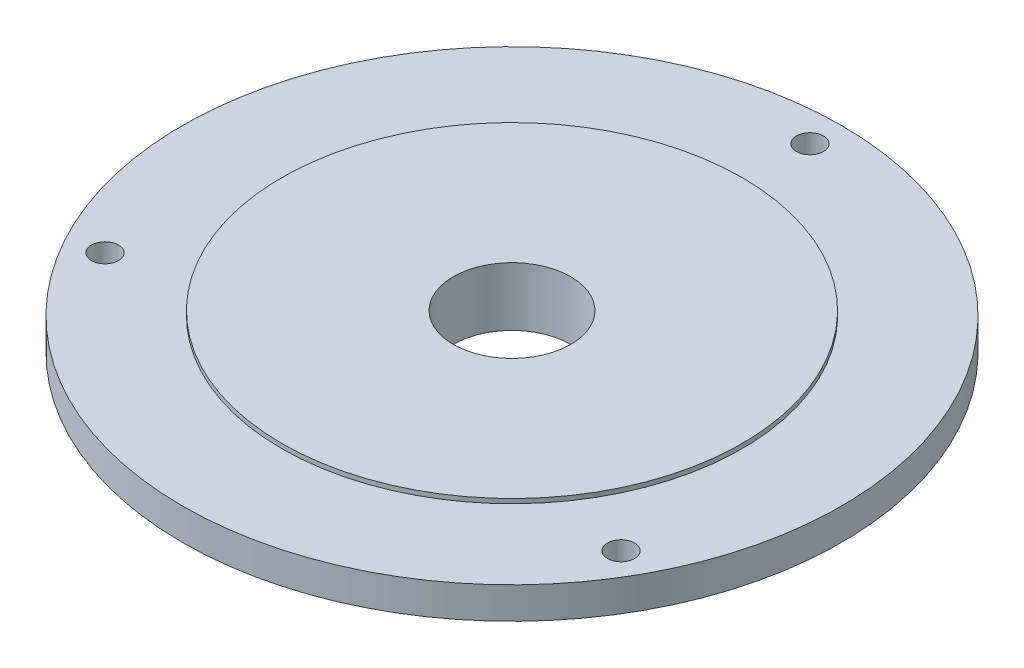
from build123d import *

# Parameters (mm, degrees)
SCHIZZO2_R               = 1.5
TAGLIO_ESTRUSIONE1_DEPTH = 52.966335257


with BuildPart() as part:
    # Schizzo1 → Rivoluzione1 (revolve)
    with BuildSketch(Plane.XY, mode=Mode.PRIVATE) as rivoluzione1_sk:
        Polygon((36.5, 37.885931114), (36.5, 34.385931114), (14.25, 34.385931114), (14.25, 31.885931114), (6.5, 31.885931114), (6.5, 38.385931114), (25.5, 38.385931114), (25.5, 37.885931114), align=None)
    revolve(rivoluzione1_sk.sketch.rotate(Axis((0, 0, 0), (0, 1, 0)), 90), axis=Axis((0, 0, 0), (0, 1, 0)))

    # Schizzo2 → Taglio-Estrusione1 (cut, through all)
    with BuildSketch(Plane(origin=(0, 37.885931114, 0), x_dir=(1, 0, 0), z_dir=(0, 1, 0))):
        with Locations(Location((0, 33, 0), (0, 0, 270))):
            Circle(SCHIZZO2_R)
        with Locations(Location((28.578838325, -16.5, 0), (0, 0, 270))):
            Circle(SCHIZZO2_R)
        with Locations(Location((-28.578838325, -16.5, 0), (0, 0, 270))):
            Circle(SCHIZZO2_R)
    extrude(amount=-TAGLIO_ESTRUSIONE1_DEPTH, mode=Mode.SUBTRACT)


solid = part.part
